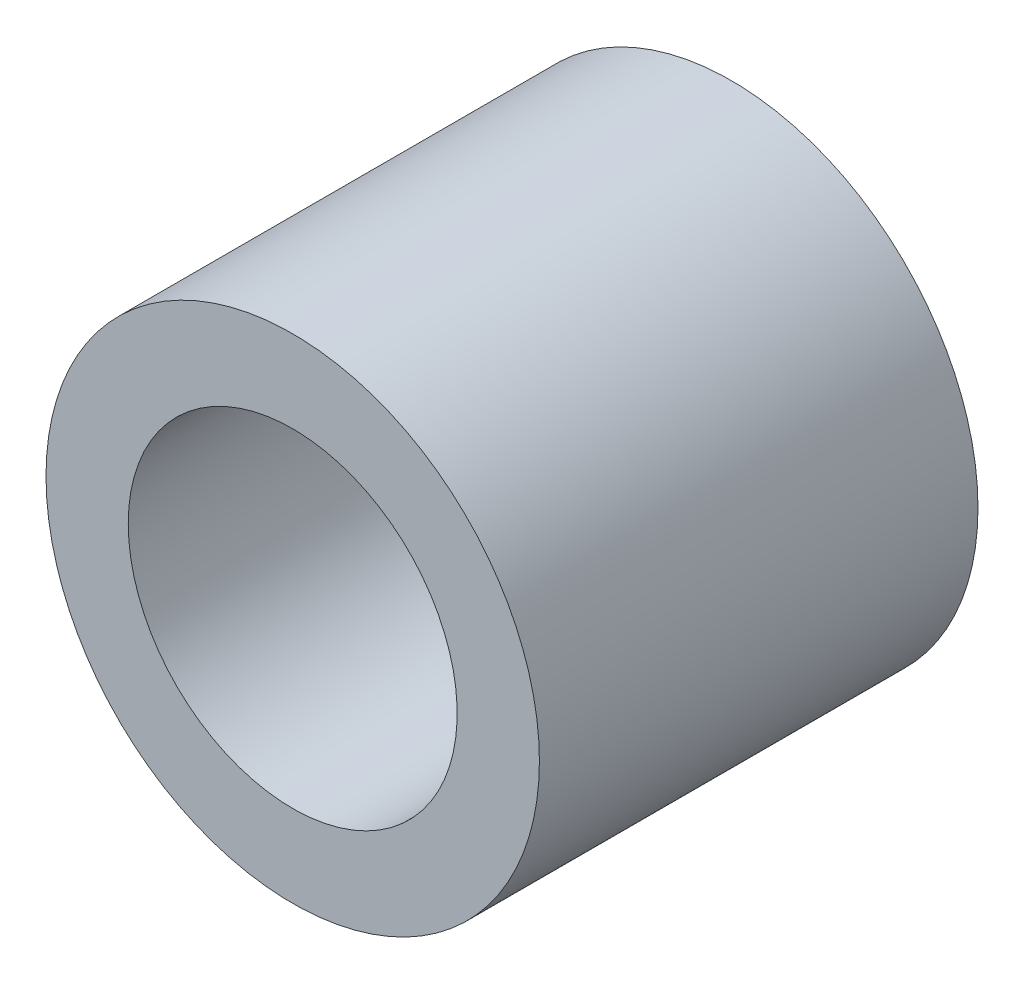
from build123d import *

# Parameters (mm, degrees)
ESQUISSE1_R          = 9
ESQUISSE1_R_2        = 6
BASE_EXTRUSION_DEPTH = 16


with BuildPart() as part:
    # Esquisse1 → Base-Extrusion (new body)
    with BuildSketch(Plane.XY):
        Circle(ESQUISSE1_R)
        Circle(ESQUISSE1_R_2, mode=Mode.SUBTRACT)
    extrude(amount=BASE_EXTRUSION_DEPTH)


solid = part.part
